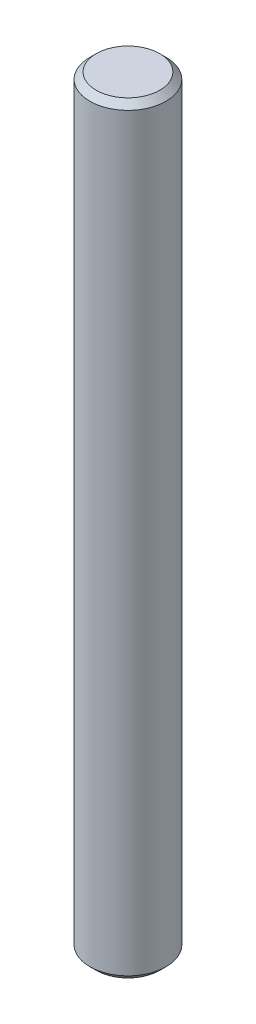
ISO-10303-21;
HEADER;
FILE_DESCRIPTION(('STEP AP214'),'2;1');
FILE_NAME('part.step','',(''),(''),'','','');
FILE_SCHEMA(('AUTOMOTIVE_DESIGN { 1 0 10303 214 1 1 1 1 }'));
ENDSEC;
DATA;
#1=APPLICATION_CONTEXT('core data for automotive mechanical design processes');
#2=APPLICATION_PROTOCOL_DEFINITION('international standard','automotive_design',2000,#1);
#3=PRODUCT_CONTEXT('',#1,'mechanical');
#4=PRODUCT('Part','Part','',(#3));
#5=PRODUCT_RELATED_PRODUCT_CATEGORY('part','',(#4));
#6=PRODUCT_DEFINITION_FORMATION('','',#4);
#7=PRODUCT_DEFINITION_CONTEXT('part definition',#1,'design');
#8=PRODUCT_DEFINITION('design','',#6,#7);
#9=PRODUCT_DEFINITION_SHAPE('','',#8);
#10=(LENGTH_UNIT() NAMED_UNIT(*) SI_UNIT(.MILLI.,.METRE.));
#11=(NAMED_UNIT(*) PLANE_ANGLE_UNIT() SI_UNIT($,.RADIAN.));
#12=(NAMED_UNIT(*) SI_UNIT($,.STERADIAN.) SOLID_ANGLE_UNIT());
#13=UNCERTAINTY_MEASURE_WITH_UNIT(LENGTH_MEASURE(1.E-05),#10,'distance_accuracy_value','');
#14=(GEOMETRIC_REPRESENTATION_CONTEXT(3) GLOBAL_UNCERTAINTY_ASSIGNED_CONTEXT((#13)) GLOBAL_UNIT_ASSIGNED_CONTEXT((#10,
#11,#12)) REPRESENTATION_CONTEXT('',''));
#15=CARTESIAN_POINT('',(0.,0.,0.));
#16=DIRECTION('',(0.,0.,1.));
#17=DIRECTION('',(1.,0.,0.));
#18=AXIS2_PLACEMENT_3D('',#15,#16,#17);
#19=CARTESIAN_POINT('',(0.,15.,0.));
#20=DIRECTION('',(0.,-1.,0.));
#21=DIRECTION('',(0.,0.,-1.));
#22=AXIS2_PLACEMENT_3D('',#19,#20,#21);
#23=CYLINDRICAL_SURFACE('',#22,1.5);
#24=CARTESIAN_POINT('',(0.,-14.75,0.));
#25=DIRECTION('',(0.,1.,0.));
#26=DIRECTION('',(0.,0.,1.));
#27=AXIS2_PLACEMENT_3D('',#24,#25,#26);
#28=CIRCLE('',#27,1.5);
#29=CARTESIAN_POINT('',(0.,-14.75,1.5));
#30=VERTEX_POINT('',#29);
#31=EDGE_CURVE('E40',#30,#30,#28,.T.);
#32=ORIENTED_EDGE('',*,*,#31,.T.);
#33=EDGE_LOOP('',(#32));
#34=FACE_BOUND('',#33,.T.);
#35=CARTESIAN_POINT('',(0.,14.75,0.));
#36=DIRECTION('',(0.,1.,0.));
#37=DIRECTION('',(0.,0.,1.));
#38=AXIS2_PLACEMENT_3D('',#35,#36,#37);
#39=CIRCLE('',#38,1.5);
#40=CARTESIAN_POINT('',(0.,14.75,1.5));
#41=VERTEX_POINT('',#40);
#42=EDGE_CURVE('E44',#41,#41,#39,.F.);
#43=ORIENTED_EDGE('',*,*,#42,.T.);
#44=EDGE_LOOP('',(#43));
#45=FACE_BOUND('',#44,.T.);
#46=ADVANCED_FACE('F29',(#34,#45),#23,.T.);
#47=CARTESIAN_POINT('',(0.,15.,0.));
#48=DIRECTION('',(0.,1.,0.));
#49=DIRECTION('',(0.,0.,1.));
#50=AXIS2_PLACEMENT_3D('',#47,#48,#49);
#51=PLANE('',#50);
#52=CARTESIAN_POINT('',(0.,15.,0.));
#53=DIRECTION('',(0.,1.,0.));
#54=DIRECTION('',(0.,0.,1.));
#55=AXIS2_PLACEMENT_3D('',#52,#53,#54);
#56=CIRCLE('',#55,1.25);
#57=CARTESIAN_POINT('',(0.,15.,1.25));
#58=VERTEX_POINT('',#57);
#59=EDGE_CURVE('E10',#58,#58,#56,.T.);
#60=ORIENTED_EDGE('',*,*,#59,.T.);
#61=EDGE_LOOP('',(#60));
#62=FACE_BOUND('',#61,.T.);
#63=ADVANCED_FACE('F60',(#62),#51,.T.);
#64=CARTESIAN_POINT('',(0.,-15.,0.));
#65=DIRECTION('',(0.,1.,0.));
#66=DIRECTION('',(0.,0.,1.));
#67=AXIS2_PLACEMENT_3D('',#64,#65,#66);
#68=PLANE('',#67);
#69=CARTESIAN_POINT('',(0.,-15.,0.));
#70=DIRECTION('',(0.,1.,0.));
#71=DIRECTION('',(0.,0.,1.));
#72=AXIS2_PLACEMENT_3D('',#69,#70,#71);
#73=CIRCLE('',#72,1.25);
#74=CARTESIAN_POINT('',(0.,-15.,1.25));
#75=VERTEX_POINT('',#74);
#76=EDGE_CURVE('E36',#75,#75,#73,.F.);
#77=ORIENTED_EDGE('',*,*,#76,.T.);
#78=EDGE_LOOP('',(#77));
#79=FACE_BOUND('',#78,.T.);
#80=ADVANCED_FACE('F57',(#79),#68,.F.);
#81=CARTESIAN_POINT('',(0.,-14.75,0.));
#82=DIRECTION('',(0.,1.,0.));
#83=DIRECTION('',(0.,0.,1.));
#84=AXIS2_PLACEMENT_3D('',#81,#82,#83);
#85=CONICAL_SURFACE('',#84,1.5,0.785398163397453);
#86=ORIENTED_EDGE('',*,*,#76,.F.);
#87=EDGE_LOOP('',(#86));
#88=FACE_BOUND('',#87,.T.);
#89=ORIENTED_EDGE('',*,*,#31,.F.);
#90=EDGE_LOOP('',(#89));
#91=FACE_BOUND('',#90,.T.);
#92=ADVANCED_FACE('F53',(#88,#91),#85,.T.);
#93=CARTESIAN_POINT('',(0.,15.,0.));
#94=DIRECTION('',(0.,-1.,0.));
#95=DIRECTION('',(0.,0.,-1.));
#96=AXIS2_PLACEMENT_3D('',#93,#94,#95);
#97=CONICAL_SURFACE('',#96,1.25,0.785398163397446);
#98=ORIENTED_EDGE('',*,*,#42,.F.);
#99=EDGE_LOOP('',(#98));
#100=FACE_BOUND('',#99,.T.);
#101=ORIENTED_EDGE('',*,*,#59,.F.);
#102=EDGE_LOOP('',(#101));
#103=FACE_BOUND('',#102,.T.);
#104=ADVANCED_FACE('F31',(#100,#103),#97,.T.);
#105=CLOSED_SHELL('',(#46,#63,#80,#92,#104));
#106=MANIFOLD_SOLID_BREP('B2',#105);
#107=ADVANCED_BREP_SHAPE_REPRESENTATION('',(#18,#106),#14);
#108=SHAPE_DEFINITION_REPRESENTATION(#9,#107);
ENDSEC;
END-ISO-10303-21;
